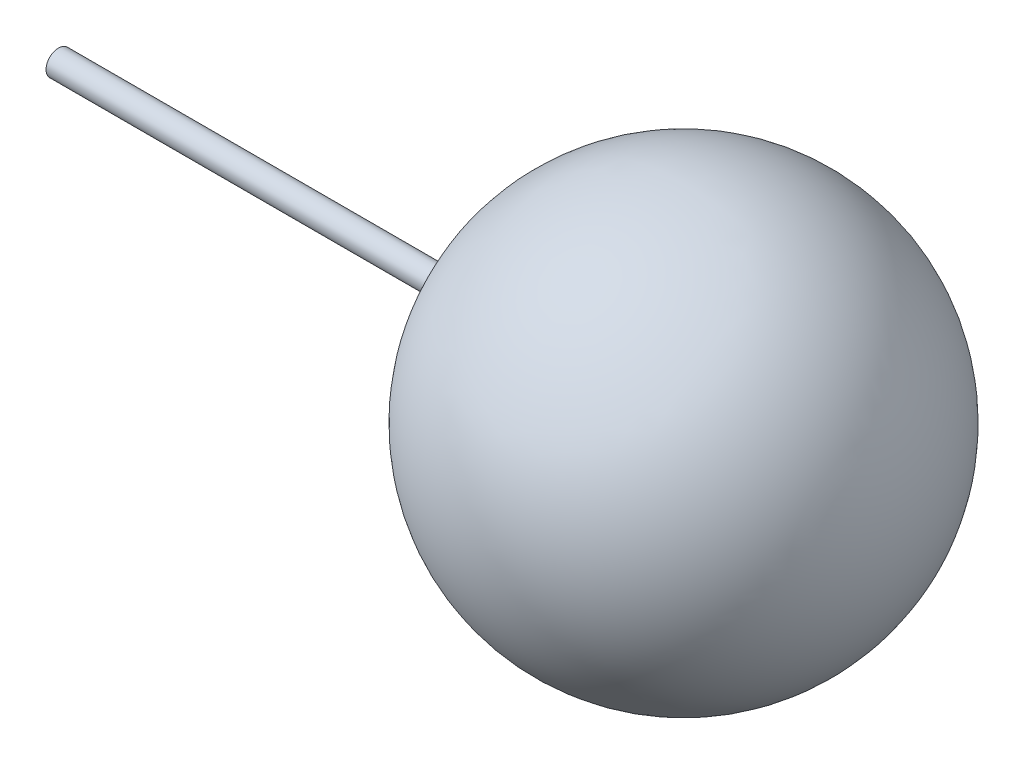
from build123d import *


with BuildPart() as part:
    # Skizze1 → Rotation1 (revolve)
    with BuildSketch(Plane.XY):
        with BuildLine():
            Line((-50, 0), (50, 0))
            ThreePointArc((50, 0), (1.500676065, 49.97747464), (-49.909918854, 3))
            Line((-49.909918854, 3), (-150, 3))
            Line((-150, 3), (-150, 0))
            Line((-150, 0), (-50, 0))
        make_face()
    revolve(axis=Axis((-50, 0, 0), (1, 0, 0)))


solid = part.part
